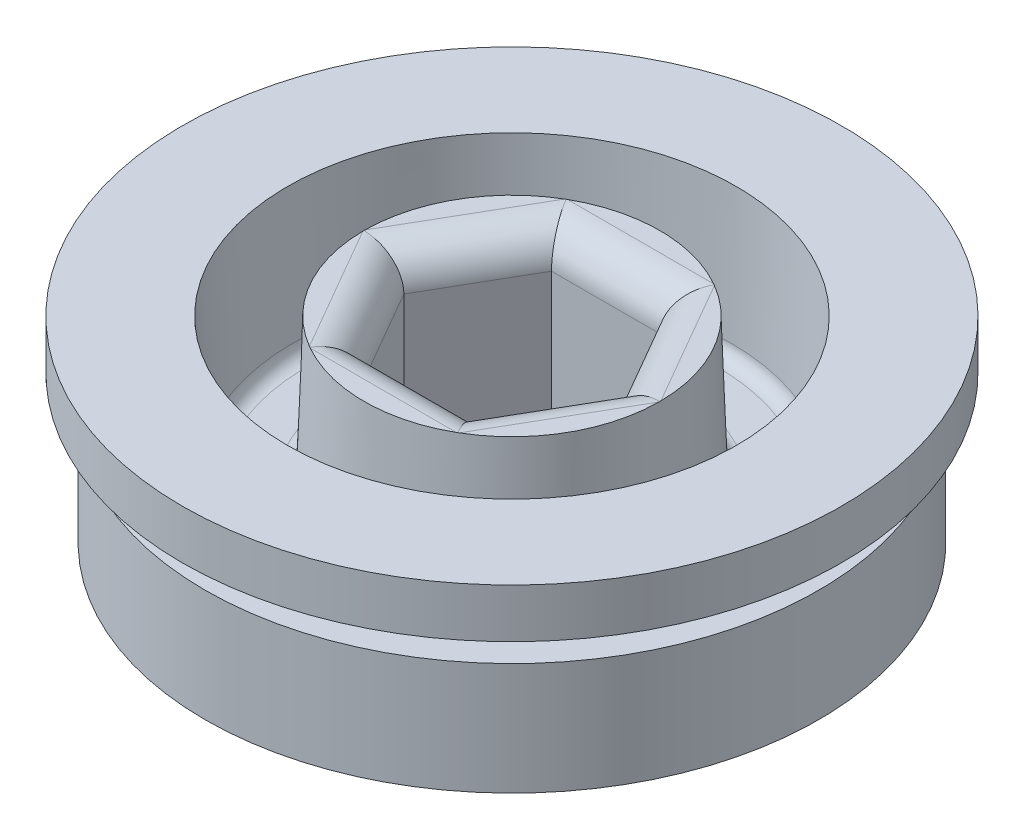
ISO-10303-21;
HEADER;
FILE_DESCRIPTION(('STEP AP214'),'2;1');
FILE_NAME('part.step','',(''),(''),'','','');
FILE_SCHEMA(('AUTOMOTIVE_DESIGN { 1 0 10303 214 1 1 1 1 }'));
ENDSEC;
DATA;
#1=APPLICATION_CONTEXT('core data for automotive mechanical design processes');
#2=APPLICATION_PROTOCOL_DEFINITION('international standard','automotive_design',2000,#1);
#3=PRODUCT_CONTEXT('',#1,'mechanical');
#4=PRODUCT('Part','Part','',(#3));
#5=PRODUCT_RELATED_PRODUCT_CATEGORY('part','',(#4));
#6=PRODUCT_DEFINITION_FORMATION('','',#4);
#7=PRODUCT_DEFINITION_CONTEXT('part definition',#1,'design');
#8=PRODUCT_DEFINITION('design','',#6,#7);
#9=PRODUCT_DEFINITION_SHAPE('','',#8);
#10=(LENGTH_UNIT() NAMED_UNIT(*) SI_UNIT(.MILLI.,.METRE.));
#11=(NAMED_UNIT(*) PLANE_ANGLE_UNIT() SI_UNIT($,.RADIAN.));
#12=(NAMED_UNIT(*) SI_UNIT($,.STERADIAN.) SOLID_ANGLE_UNIT());
#13=UNCERTAINTY_MEASURE_WITH_UNIT(LENGTH_MEASURE(1.E-05),#10,'distance_accuracy_value','');
#14=(GEOMETRIC_REPRESENTATION_CONTEXT(3) GLOBAL_UNCERTAINTY_ASSIGNED_CONTEXT((#13)) GLOBAL_UNIT_ASSIGNED_CONTEXT((#10,
#11,#12)) REPRESENTATION_CONTEXT('',''));
#15=CARTESIAN_POINT('',(0.,0.,0.));
#16=DIRECTION('',(0.,0.,1.));
#17=DIRECTION('',(1.,0.,0.));
#18=AXIS2_PLACEMENT_3D('',#15,#16,#17);
#19=CARTESIAN_POINT('',(0.,1.778,0.));
#20=DIRECTION('',(0.,1.,0.));
#21=DIRECTION('',(0.,0.,1.));
#22=AXIS2_PLACEMENT_3D('',#19,#20,#21);
#23=PLANE('',#22);
#24=DIRECTION('',(0.5,0.,-0.866025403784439));
#25=VECTOR('',#24,1.);
#26=CARTESIAN_POINT('',(3.05758929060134,1.778,4.0259));
#27=LINE('',#26,#25);
#28=CARTESIAN_POINT('',(5.35925593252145,1.778,0.0392964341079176));
#29=VERTEX_POINT('',#28);
#30=CARTESIAN_POINT('',(2.71365967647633,1.778,4.62160356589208));
#31=VERTEX_POINT('',#30);
#32=EDGE_CURVE('E158',#29,#31,#27,.F.);
#33=ORIENTED_EDGE('',*,*,#32,.T.);
#34=CARTESIAN_POINT('',(0.,1.778,0.));
#35=DIRECTION('',(0.,1.,0.));
#36=DIRECTION('',(0.,0.,1.));
#37=AXIS2_PLACEMENT_3D('',#34,#35,#36);
#38=CIRCLE('',#37,5.3594);
#39=EDGE_CURVE('E153',#31,#29,#38,.T.);
#40=ORIENTED_EDGE('',*,*,#39,.T.);
#41=EDGE_LOOP('',(#33,#40));
#42=FACE_BOUND('',#41,.T.);
#43=ADVANCED_FACE('F28',(#42),#23,.T.);
#44=DIRECTION('',(0.5,0.,0.866025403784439));
#45=VECTOR('',#44,1.);
#46=CARTESIAN_POINT('',(4.03645780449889,1.778,-2.33045));
#47=LINE('',#46,#45);
#48=CARTESIAN_POINT('',(2.71365967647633,1.778,-4.62160356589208));
#49=VERTEX_POINT('',#48);
#50=CARTESIAN_POINT('',(5.35925593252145,1.778,-0.0392964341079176));
#51=VERTEX_POINT('',#50);
#52=EDGE_CURVE('E164',#49,#51,#47,.T.);
#53=ORIENTED_EDGE('',*,*,#52,.T.);
#54=EDGE_CURVE('E357',#51,#49,#38,.T.);
#55=ORIENTED_EDGE('',*,*,#54,.T.);
#56=EDGE_LOOP('',(#53,#55));
#57=FACE_BOUND('',#56,.T.);
#58=ADVANCED_FACE('F314',(#57),#23,.T.);
#59=DIRECTION('',(1.,0.,0.));
#60=VECTOR('',#59,1.);
#61=CARTESIAN_POINT('',(0.,1.778,-4.6609));
#62=LINE('',#61,#60);
#63=CARTESIAN_POINT('',(-2.64559625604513,1.778,-4.6609));
#64=VERTEX_POINT('',#63);
#65=CARTESIAN_POINT('',(2.64559625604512,1.778,-4.6609));
#66=VERTEX_POINT('',#65);
#67=EDGE_CURVE('E556',#64,#66,#62,.T.);
#68=ORIENTED_EDGE('',*,*,#67,.T.);
#69=EDGE_CURVE('E359',#66,#64,#38,.T.);
#70=ORIENTED_EDGE('',*,*,#69,.T.);
#71=EDGE_LOOP('',(#68,#70));
#72=FACE_BOUND('',#71,.T.);
#73=ADVANCED_FACE('F326',(#72),#23,.T.);
#74=DIRECTION('',(-0.5,0.,0.866025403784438));
#75=VECTOR('',#74,1.);
#76=CARTESIAN_POINT('',(-3.05758929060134,1.778,-4.0259));
#77=LINE('',#76,#75);
#78=CARTESIAN_POINT('',(-5.35925593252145,1.778,-0.0392964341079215));
#79=VERTEX_POINT('',#78);
#80=CARTESIAN_POINT('',(-2.71365967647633,1.778,-4.62160356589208));
#81=VERTEX_POINT('',#80);
#82=EDGE_CURVE('E161',#79,#81,#77,.F.);
#83=ORIENTED_EDGE('',*,*,#82,.T.);
#84=EDGE_CURVE('E362',#81,#79,#38,.T.);
#85=ORIENTED_EDGE('',*,*,#84,.T.);
#86=EDGE_LOOP('',(#83,#85));
#87=FACE_BOUND('',#86,.T.);
#88=ADVANCED_FACE('F321',(#87),#23,.T.);
#89=DIRECTION('',(-0.5,0.,-0.866025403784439));
#90=VECTOR('',#89,1.);
#91=CARTESIAN_POINT('',(-4.03645780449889,1.778,2.33045));
#92=LINE('',#91,#90);
#93=CARTESIAN_POINT('',(-2.71365967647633,1.778,4.62160356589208));
#94=VERTEX_POINT('',#93);
#95=CARTESIAN_POINT('',(-5.35925593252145,1.778,0.039296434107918));
#96=VERTEX_POINT('',#95);
#97=EDGE_CURVE('E157',#94,#96,#92,.T.);
#98=ORIENTED_EDGE('',*,*,#97,.T.);
#99=EDGE_CURVE('E151',#96,#94,#38,.T.);
#100=ORIENTED_EDGE('',*,*,#99,.T.);
#101=EDGE_LOOP('',(#98,#100));
#102=FACE_BOUND('',#101,.T.);
#103=ADVANCED_FACE('F317',(#102),#23,.T.);
#104=DIRECTION('',(1.,0.,0.));
#105=VECTOR('',#104,1.);
#106=CARTESIAN_POINT('',(-1.9577370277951,1.778,4.6609));
#107=LINE('',#106,#105);
#108=CARTESIAN_POINT('',(2.64559625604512,1.778,4.6609));
#109=VERTEX_POINT('',#108);
#110=CARTESIAN_POINT('',(-2.64559625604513,1.778,4.6609));
#111=VERTEX_POINT('',#110);
#112=EDGE_CURVE('E150',#109,#111,#107,.F.);
#113=ORIENTED_EDGE('',*,*,#112,.T.);
#114=EDGE_CURVE('E138',#111,#109,#38,.T.);
#115=ORIENTED_EDGE('',*,*,#114,.T.);
#116=EDGE_LOOP('',(#113,#115));
#117=FACE_BOUND('',#116,.T.);
#118=ADVANCED_FACE('F149',(#117),#23,.T.);
#119=CARTESIAN_POINT('',(3.05758929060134,0.508,4.0259));
#120=DIRECTION('',(-0.5,0.,0.866025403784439));
#121=DIRECTION('',(0.866025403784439,0.,0.5));
#122=AXIS2_PLACEMENT_3D('',#119,#120,#121);
#123=CYLINDRICAL_SURFACE('',#122,1.27);
#124=CARTESIAN_POINT('',(2.69097186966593,0.508,4.6609));
#125=DIRECTION('',(-0.866025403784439,0.,0.5));
#126=DIRECTION('',(-0.5,0.,-0.866025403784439));
#127=AXIS2_PLACEMENT_3D('',#124,#125,#126);
#128=ELLIPSE('',#127,1.46646968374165,1.27);
#129=CARTESIAN_POINT('',(2.67970261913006,1.77784999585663,4.64138108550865));
#130=VERTEX_POINT('',#129);
#131=CARTESIAN_POINT('',(1.9577370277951,0.507999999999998,3.3909));
#132=VERTEX_POINT('',#131);
#133=EDGE_CURVE('E355',#130,#132,#128,.T.);
#134=ORIENTED_EDGE('',*,*,#133,.F.);
#135=CARTESIAN_POINT('',(2.64528726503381,1.77738669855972,4.66110000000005));
#136=CARTESIAN_POINT('',(2.70307202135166,1.77842549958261,4.62826566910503));
#137=CARTESIAN_POINT('',(2.76026595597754,1.77810903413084,4.59439620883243));
#138=CARTESIAN_POINT('',(2.87333157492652,1.77521470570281,4.52466381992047));
#139=CARTESIAN_POINT('',(2.92920388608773,1.77263793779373,4.48880186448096));
#140=CARTESIAN_POINT('',(3.09449500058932,1.76220307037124,4.37843720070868));
#141=CARTESIAN_POINT('',(3.2018147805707,1.75164094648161,4.30102683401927));
#142=CARTESIAN_POINT('',(3.41087950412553,1.72635068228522,4.13836618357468));
#143=CARTESIAN_POINT('',(3.51258376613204,1.71159596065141,4.05306829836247));
#144=CARTESIAN_POINT('',(3.70938130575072,1.68083102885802,3.87525940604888));
#145=CARTESIAN_POINT('',(3.80447070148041,1.66482009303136,3.78274422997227));
#146=CARTESIAN_POINT('',(3.99114982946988,1.63370806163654,3.58704740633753));
#147=CARTESIAN_POINT('',(4.08246341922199,1.61866581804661,3.48359208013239));
#148=CARTESIAN_POINT('',(4.25695808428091,1.59303451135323,3.26952688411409));
#149=CARTESIAN_POINT('',(4.34014138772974,1.58244422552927,3.15891898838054));
#150=CARTESIAN_POINT('',(4.49734087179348,1.56791987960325,2.9316842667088));
#151=CARTESIAN_POINT('',(4.57139773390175,1.56395521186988,2.81508769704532));
#152=CARTESIAN_POINT('',(4.71007077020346,1.56345579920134,2.57639531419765));
#153=CARTESIAN_POINT('',(4.77468720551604,1.566920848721,2.45429965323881));
#154=CARTESIAN_POINT('',(4.89099141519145,1.5801758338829,2.21192929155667));
#155=CARTESIAN_POINT('',(4.94316314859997,1.589641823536,2.09186728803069));
#156=CARTESIAN_POINT('',(5.03834619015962,1.61282715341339,1.84855866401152));
#157=CARTESIAN_POINT('',(5.0813553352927,1.62654749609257,1.72531129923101));
#158=CARTESIAN_POINT('',(5.15825191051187,1.65593634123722,1.47593333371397));
#159=CARTESIAN_POINT('',(5.19211837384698,1.67160920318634,1.34979681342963));
#160=CARTESIAN_POINT('',(5.25060377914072,1.70228585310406,1.09531971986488));
#161=CARTESIAN_POINT('',(5.27522239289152,1.71728961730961,0.96697906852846));
#162=CARTESIAN_POINT('',(5.31657096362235,1.7448339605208,0.699441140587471));
#163=CARTESIAN_POINT('',(5.33263107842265,1.75712980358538,0.560110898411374));
#164=CARTESIAN_POINT('',(5.34867875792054,1.7699082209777,0.350339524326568));
#165=CARTESIAN_POINT('',(5.3526875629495,1.77322291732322,0.28036486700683));
#166=CARTESIAN_POINT('',(5.35804439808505,1.77746100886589,0.140199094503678));
#167=CARTESIAN_POINT('',(5.35939070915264,1.77838285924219,0.0700078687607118));
#168=CARTESIAN_POINT('',(5.35940528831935,1.77784845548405,-0.000200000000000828));
#169=B_SPLINE_CURVE_WITH_KNOTS('',3,(#135,#136,#137,#138,#139,#140,#141,#142,#143,#144,#145,
#146,#147,#148,#149,#150,#151,#152,#153,#154,#155,#156,#157,#158,#159,#160,#161,#162,#163,#164,
#165,#166,#167,#168),.UNSPECIFIED.,.F.,.F.,(4,2,2,2,2,2,2,2,2,2,2,2,2,2,2,2,4),(0.,
0.19934792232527,0.398599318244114,0.796322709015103,1.19662621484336,1.59716268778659,
2.01313680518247,2.42899660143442,2.84292993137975,3.25685180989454,3.65013721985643,
4.04351537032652,4.43778812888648,4.83207487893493,5.25385746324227,5.46427993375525,
5.67483821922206),.UNSPECIFIED.);
#170=EDGE_CURVE('E141',#130,#31,#169,.T.);
#171=ORIENTED_EDGE('',*,*,#170,.T.);
#172=ORIENTED_EDGE('',*,*,#32,.F.);
#173=CARTESIAN_POINT('',(5.35940523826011,1.77784999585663,0.));
#174=VERTEX_POINT('',#173);
#175=EDGE_CURVE('E349',#29,#174,#169,.T.);
#176=ORIENTED_EDGE('',*,*,#175,.T.);
#177=CARTESIAN_POINT('',(5.38194373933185,0.508,0.));
#178=DIRECTION('',(0.,0.,1.));
#179=DIRECTION('',(-1.,0.,0.));
#180=AXIS2_PLACEMENT_3D('',#177,#178,#179);
#181=ELLIPSE('',#180,1.46646968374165,1.27);
#182=CARTESIAN_POINT('',(3.9154740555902,0.507999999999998,0.));
#183=VERTEX_POINT('',#182);
#184=EDGE_CURVE('E558',#183,#174,#181,.F.);
#185=ORIENTED_EDGE('',*,*,#184,.F.);
#186=DIRECTION('',(0.5,0.,-0.866025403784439));
#187=VECTOR('',#186,1.);
#188=CARTESIAN_POINT('',(3.9154740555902,0.508,0.));
#189=LINE('',#188,#187);
#190=EDGE_CURVE('E176',#132,#183,#189,.T.);
#191=ORIENTED_EDGE('',*,*,#190,.F.);
#192=EDGE_LOOP('',(#134,#171,#172,#176,#185,#191));
#193=FACE_BOUND('',#192,.T.);
#194=ADVANCED_FACE('F253',(#193),#123,.T.);
#195=CARTESIAN_POINT('',(4.03645780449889,0.508,-2.33045));
#196=DIRECTION('',(0.5,0.,0.866025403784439));
#197=DIRECTION('',(0.866025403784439,0.,-0.5));
#198=AXIS2_PLACEMENT_3D('',#195,#196,#197);
#199=CYLINDRICAL_SURFACE('',#198,1.27);
#200=ORIENTED_EDGE('',*,*,#184,.T.);
#201=CARTESIAN_POINT('',(5.35940528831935,1.77784845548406,0.00020000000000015));
#202=CARTESIAN_POINT('',(5.35939117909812,1.77836172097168,-0.0671206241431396));
#203=CARTESIAN_POINT('',(5.35815274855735,1.77753489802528,-0.134427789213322));
#204=CARTESIAN_POINT('',(5.35322574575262,1.7736595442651,-0.268860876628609));
#205=CARTESIAN_POINT('',(5.34953825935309,1.77061199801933,-0.335986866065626));
#206=CARTESIAN_POINT('',(5.3348165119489,1.75883851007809,-0.53670335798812));
#207=CARTESIAN_POINT('',(5.32012290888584,1.7474802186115,-0.669882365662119));
#208=CARTESIAN_POINT('',(5.28091153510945,1.72086401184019,-0.935226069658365));
#209=CARTESIAN_POINT('',(5.25633104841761,1.70558143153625,-1.06737869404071));
#210=CARTESIAN_POINT('',(5.19737173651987,1.67412266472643,-1.32944996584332));
#211=CARTESIAN_POINT('',(5.16298749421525,1.65794598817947,-1.45936733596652));
#212=CARTESIAN_POINT('',(5.08288029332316,1.6269424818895,-1.72150405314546));
#213=CARTESIAN_POINT('',(5.03676535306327,1.61219352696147,-1.85361369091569));
#214=CARTESIAN_POINT('',(4.93401205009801,1.58768787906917,-2.11413411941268));
#215=CARTESIAN_POINT('',(4.87737756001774,1.57792935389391,-2.24254625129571));
#216=CARTESIAN_POINT('',(4.75410299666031,1.56551293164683,-2.49415214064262));
#217=CARTESIAN_POINT('',(4.68750844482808,1.56282371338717,-2.61736652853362));
#218=CARTESIAN_POINT('',(4.54469595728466,1.56506544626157,-2.85801383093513));
#219=CARTESIAN_POINT('',(4.4684777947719,1.56999657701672,-2.97544660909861));
#220=CARTESIAN_POINT('',(4.3128075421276,1.58579954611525,-3.1955816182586));
#221=CARTESIAN_POINT('',(4.23395127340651,1.59623329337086,-3.2987400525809));
#222=CARTESIAN_POINT('',(4.06908419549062,1.62085850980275,-3.49876891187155));
#223=CARTESIAN_POINT('',(3.98306918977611,1.63505219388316,-3.59563558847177));
#224=CARTESIAN_POINT('',(3.80421241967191,1.66486586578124,-3.78289448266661));
#225=CARTESIAN_POINT('',(3.71136004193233,1.68048808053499,-3.87327618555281));
#226=CARTESIAN_POINT('',(3.5192854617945,1.71058043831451,-4.04719998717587));
#227=CARTESIAN_POINT('',(3.4200633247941,1.72505059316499,-4.13074215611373));
#228=CARTESIAN_POINT('',(3.2117054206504,1.75061994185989,-4.29377464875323));
#229=CARTESIAN_POINT('',(3.1023371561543,1.76157189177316,-4.37299442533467));
#230=CARTESIAN_POINT('',(2.93398231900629,1.77239912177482,-4.48570685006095));
#231=CARTESIAN_POINT('',(2.87719191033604,1.77507483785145,-4.52223258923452));
#232=CARTESIAN_POINT('',(2.76223468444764,1.77809753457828,-4.59322998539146));
#233=CARTESIAN_POINT('',(2.70406702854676,1.77844305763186,-4.62770034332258));
#234=CARTESIAN_POINT('',(2.64528726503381,1.77738669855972,-4.66110000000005));
#235=B_SPLINE_CURVE_WITH_KNOTS('',3,(#201,#202,#203,#204,#205,#206,#207,#208,#209,#210,#211,
#212,#213,#214,#215,#216,#217,#218,#219,#220,#221,#222,#223,#224,#225,#226,#227,#228,#229,#230,
#231,#232,#233,#234),.UNSPECIFIED.,.F.,.F.,(4,2,2,2,2,2,2,2,2,2,2,2,2,2,2,2,4),(0.,
0.201905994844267,0.40372252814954,0.80660861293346,1.21209169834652,1.61779927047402,
2.03942655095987,2.46089892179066,2.88050075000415,3.30011246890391,3.69047295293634,
4.0810639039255,4.4722744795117,4.86348103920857,5.26940034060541,5.4720511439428,
5.67482869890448),.UNSPECIFIED.);
#236=EDGE_CURVE('E345',#174,#51,#235,.T.);
#237=ORIENTED_EDGE('',*,*,#236,.T.);
#238=ORIENTED_EDGE('',*,*,#52,.F.);
#239=CARTESIAN_POINT('',(2.67970261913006,1.77784999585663,-4.64138108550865));
#240=VERTEX_POINT('',#239);
#241=EDGE_CURVE('E145',#49,#240,#235,.T.);
#242=ORIENTED_EDGE('',*,*,#241,.T.);
#243=CARTESIAN_POINT('',(2.69097186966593,0.508,-4.6609));
#244=DIRECTION('',(0.866025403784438,0.,0.5));
#245=DIRECTION('',(-0.5,0.,0.866025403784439));
#246=AXIS2_PLACEMENT_3D('',#243,#244,#245);
#247=ELLIPSE('',#246,1.46646968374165,1.27);
#248=CARTESIAN_POINT('',(1.9577370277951,0.507999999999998,-3.3909));
#249=VERTEX_POINT('',#248);
#250=EDGE_CURVE('E563',#249,#240,#247,.F.);
#251=ORIENTED_EDGE('',*,*,#250,.F.);
#252=DIRECTION('',(0.5,0.,0.866025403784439));
#253=VECTOR('',#252,1.);
#254=CARTESIAN_POINT('',(1.9577370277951,0.508,-3.3909));
#255=LINE('',#254,#253);
#256=EDGE_CURVE('E51',#183,#249,#255,.F.);
#257=ORIENTED_EDGE('',*,*,#256,.F.);
#258=EDGE_LOOP('',(#200,#237,#238,#242,#251,#257));
#259=FACE_BOUND('',#258,.T.);
#260=ADVANCED_FACE('F248',(#259),#199,.T.);
#261=CARTESIAN_POINT('',(-1.9577370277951,0.508,4.6609));
#262=DIRECTION('',(-1.,0.,0.));
#263=DIRECTION('',(0.,0.,1.));
#264=AXIS2_PLACEMENT_3D('',#261,#262,#263);
#265=CYLINDRICAL_SURFACE('',#264,1.27);
#266=ORIENTED_EDGE('',*,*,#112,.F.);
#267=CARTESIAN_POINT('',(2.6452438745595,1.77799998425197,4.6611));
#268=CARTESIAN_POINT('',(2.65291964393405,1.77800104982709,4.6567438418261));
#269=CARTESIAN_POINT('',(2.66058486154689,1.77797913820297,4.65236953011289));
#270=CARTESIAN_POINT('',(2.67589419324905,1.77788936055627,4.64358459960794));
#271=CARTESIAN_POINT('',(2.68353830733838,1.77782149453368,4.63917398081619));
#272=CARTESIAN_POINT('',(2.691171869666,1.77773065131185,4.63474520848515));
#273=B_SPLINE_CURVE_WITH_KNOTS('',3,(#267,#268,#269,#270,#271,#272),.UNSPECIFIED.,.F.,.F.,(4,2,
4),(0.,0.0264767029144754,0.0529534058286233),.UNSPECIFIED.);
#274=EDGE_CURVE('E135',#109,#130,#273,.T.);
#275=ORIENTED_EDGE('',*,*,#274,.T.);
#276=ORIENTED_EDGE('',*,*,#133,.T.);
#277=DIRECTION('',(1.,0.,0.));
#278=VECTOR('',#277,1.);
#279=CARTESIAN_POINT('',(1.9577370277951,0.508,3.3909));
#280=LINE('',#279,#278);
#281=CARTESIAN_POINT('',(-1.9577370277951,0.507999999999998,3.3909));
#282=VERTEX_POINT('',#281);
#283=EDGE_CURVE('E173',#282,#132,#280,.T.);
#284=ORIENTED_EDGE('',*,*,#283,.F.);
#285=CARTESIAN_POINT('',(-2.69097186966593,0.508,4.6609));
#286=DIRECTION('',(-0.866025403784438,0.,-0.5));
#287=DIRECTION('',(0.5,0.,-0.866025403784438));
#288=AXIS2_PLACEMENT_3D('',#285,#286,#287);
#289=ELLIPSE('',#288,1.46646968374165,1.27);
#290=CARTESIAN_POINT('',(-2.67970261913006,1.77784999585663,4.64138108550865));
#291=VERTEX_POINT('',#290);
#292=EDGE_CURVE('E610',#291,#282,#289,.T.);
#293=ORIENTED_EDGE('',*,*,#292,.F.);
#294=CARTESIAN_POINT('',(-2.691171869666,1.77773065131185,4.63474520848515));
#295=CARTESIAN_POINT('',(-2.68353830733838,1.77782149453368,4.63917398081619));
#296=CARTESIAN_POINT('',(-2.67589419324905,1.77788936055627,4.64358459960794));
#297=CARTESIAN_POINT('',(-2.66058486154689,1.77797913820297,4.65236953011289));
#298=CARTESIAN_POINT('',(-2.65291964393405,1.77800104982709,4.6567438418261));
#299=CARTESIAN_POINT('',(-2.6452438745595,1.77799998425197,4.6611));
#300=B_SPLINE_CURVE_WITH_KNOTS('',3,(#294,#295,#296,#297,#298,#299),.UNSPECIFIED.,.F.,.F.,(4,2,
4),(0.,0.0264767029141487,0.0529534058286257),.UNSPECIFIED.);
#301=EDGE_CURVE('E156',#291,#111,#300,.T.);
#302=ORIENTED_EDGE('',*,*,#301,.T.);
#303=EDGE_LOOP('',(#266,#275,#276,#284,#293,#302));
#304=FACE_BOUND('',#303,.T.);
#305=ADVANCED_FACE('F154',(#304),#265,.T.);
#306=CARTESIAN_POINT('',(0.,0.508,-4.6609));
#307=DIRECTION('',(1.,0.,0.));
#308=DIRECTION('',(0.,0.,-1.));
#309=AXIS2_PLACEMENT_3D('',#306,#307,#308);
#310=CYLINDRICAL_SURFACE('',#309,1.27);
#311=ORIENTED_EDGE('',*,*,#67,.F.);
#312=CARTESIAN_POINT('',(-2.64524387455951,1.77799998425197,-4.6611));
#313=CARTESIAN_POINT('',(-2.65291964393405,1.77800104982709,-4.6567438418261));
#314=CARTESIAN_POINT('',(-2.66058486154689,1.77797913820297,-4.65236953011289));
#315=CARTESIAN_POINT('',(-2.67589419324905,1.77788936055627,-4.64358459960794));
#316=CARTESIAN_POINT('',(-2.68353830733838,1.77782149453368,-4.63917398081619));
#317=CARTESIAN_POINT('',(-2.691171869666,1.77773065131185,-4.63474520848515));
#318=B_SPLINE_CURVE_WITH_KNOTS('',3,(#312,#313,#314,#315,#316,#317),.UNSPECIFIED.,.F.,.F.,(4,2,
4),(0.,0.0264767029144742,0.0529534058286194),.UNSPECIFIED.);
#319=CARTESIAN_POINT('',(-2.67970261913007,1.77784999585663,-4.64138108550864));
#320=VERTEX_POINT('',#319);
#321=EDGE_CURVE('E215',#64,#320,#318,.T.);
#322=ORIENTED_EDGE('',*,*,#321,.T.);
#323=CARTESIAN_POINT('',(-2.69097186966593,0.508,-4.6609));
#324=DIRECTION('',(0.866025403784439,0.,-0.5));
#325=DIRECTION('',(-0.5,0.,-0.866025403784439));
#326=AXIS2_PLACEMENT_3D('',#323,#324,#325);
#327=ELLIPSE('',#326,1.46646968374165,1.27);
#328=CARTESIAN_POINT('',(-1.9577370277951,0.507999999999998,-3.3909));
#329=VERTEX_POINT('',#328);
#330=EDGE_CURVE('E370',#329,#320,#327,.F.);
#331=ORIENTED_EDGE('',*,*,#330,.F.);
#332=DIRECTION('',(1.,0.,0.));
#333=VECTOR('',#332,1.);
#334=CARTESIAN_POINT('',(-1.9577370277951,0.508,-3.3909));
#335=LINE('',#334,#333);
#336=EDGE_CURVE('E179',#249,#329,#335,.F.);
#337=ORIENTED_EDGE('',*,*,#336,.F.);
#338=ORIENTED_EDGE('',*,*,#250,.T.);
#339=CARTESIAN_POINT('',(2.691171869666,1.77773065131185,-4.63474520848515));
#340=CARTESIAN_POINT('',(2.68353830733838,1.77782149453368,-4.63917398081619));
#341=CARTESIAN_POINT('',(2.67589419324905,1.77788936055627,-4.64358459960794));
#342=CARTESIAN_POINT('',(2.66058486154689,1.77797913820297,-4.65236953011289));
#343=CARTESIAN_POINT('',(2.65291964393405,1.77800104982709,-4.6567438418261));
#344=CARTESIAN_POINT('',(2.64524387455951,1.77799998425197,-4.6611));
#345=B_SPLINE_CURVE_WITH_KNOTS('',3,(#339,#340,#341,#342,#343,#344),.UNSPECIFIED.,.F.,.F.,(4,2,
4),(0.,0.0264767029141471,0.0529534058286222),.UNSPECIFIED.);
#346=EDGE_CURVE('E228',#240,#66,#345,.T.);
#347=ORIENTED_EDGE('',*,*,#346,.T.);
#348=EDGE_LOOP('',(#311,#322,#331,#337,#338,#347));
#349=FACE_BOUND('',#348,.T.);
#350=ADVANCED_FACE('F247',(#349),#310,.T.);
#351=CARTESIAN_POINT('',(-4.03645780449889,0.508,2.33045));
#352=DIRECTION('',(-0.5,0.,-0.866025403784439));
#353=DIRECTION('',(-0.866025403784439,0.,0.5));
#354=AXIS2_PLACEMENT_3D('',#351,#352,#353);
#355=CYLINDRICAL_SURFACE('',#354,1.27);
#356=CARTESIAN_POINT('',(-5.38194373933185,0.508,0.));
#357=DIRECTION('',(0.,0.,-1.));
#358=DIRECTION('',(1.,0.,0.));
#359=AXIS2_PLACEMENT_3D('',#356,#357,#358);
#360=ELLIPSE('',#359,1.46646968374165,1.27);
#361=CARTESIAN_POINT('',(-5.35940523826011,1.77784999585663,0.));
#362=VERTEX_POINT('',#361);
#363=CARTESIAN_POINT('',(-3.9154740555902,0.507999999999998,0.));
#364=VERTEX_POINT('',#363);
#365=EDGE_CURVE('E335',#362,#364,#360,.T.);
#366=ORIENTED_EDGE('',*,*,#365,.F.);
#367=CARTESIAN_POINT('',(-5.35940528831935,1.77784845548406,-0.000200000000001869));
#368=CARTESIAN_POINT('',(-5.35939117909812,1.77836172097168,0.0671206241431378));
#369=CARTESIAN_POINT('',(-5.35815274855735,1.77753489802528,0.13442778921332));
#370=CARTESIAN_POINT('',(-5.35322574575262,1.7736595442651,0.268860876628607));
#371=CARTESIAN_POINT('',(-5.34953825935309,1.77061199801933,0.335986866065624));
#372=CARTESIAN_POINT('',(-5.3348165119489,1.75883851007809,0.536703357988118));
#373=CARTESIAN_POINT('',(-5.32012290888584,1.7474802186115,0.669882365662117));
#374=CARTESIAN_POINT('',(-5.28091153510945,1.72086401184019,0.935226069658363));
#375=CARTESIAN_POINT('',(-5.25633104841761,1.70558143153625,1.06737869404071));
#376=CARTESIAN_POINT('',(-5.19737173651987,1.67412266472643,1.32944996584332));
#377=CARTESIAN_POINT('',(-5.16298749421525,1.65794598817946,1.45936733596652));
#378=CARTESIAN_POINT('',(-5.08288029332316,1.6269424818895,1.72150405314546));
#379=CARTESIAN_POINT('',(-5.03676535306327,1.61219352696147,1.85361369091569));
#380=CARTESIAN_POINT('',(-4.93401205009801,1.58768787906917,2.11413411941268));
#381=CARTESIAN_POINT('',(-4.87737756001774,1.57792935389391,2.24254625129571));
#382=CARTESIAN_POINT('',(-4.75410299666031,1.56551293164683,2.49415214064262));
#383=CARTESIAN_POINT('',(-4.68750844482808,1.56282371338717,2.61736652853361));
#384=CARTESIAN_POINT('',(-4.54469595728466,1.56506544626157,2.85801383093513));
#385=CARTESIAN_POINT('',(-4.46847779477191,1.56999657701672,2.97544660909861));
#386=CARTESIAN_POINT('',(-4.3128075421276,1.58579954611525,3.1955816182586));
#387=CARTESIAN_POINT('',(-4.23395127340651,1.59623329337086,3.2987400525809));
#388=CARTESIAN_POINT('',(-4.06908419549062,1.62085850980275,3.49876891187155));
#389=CARTESIAN_POINT('',(-3.98306918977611,1.63505219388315,3.59563558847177));
#390=CARTESIAN_POINT('',(-3.80421241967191,1.66486586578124,3.78289448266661));
#391=CARTESIAN_POINT('',(-3.71136004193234,1.68048808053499,3.87327618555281));
#392=CARTESIAN_POINT('',(-3.5192854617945,1.71058043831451,4.04719998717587));
#393=CARTESIAN_POINT('',(-3.4200633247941,1.72505059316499,4.13074215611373));
#394=CARTESIAN_POINT('',(-3.2117054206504,1.75061994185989,4.29377464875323));
#395=CARTESIAN_POINT('',(-3.1023371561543,1.76157189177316,4.37299442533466));
#396=CARTESIAN_POINT('',(-2.93398231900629,1.77239912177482,4.48570685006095));
#397=CARTESIAN_POINT('',(-2.87719191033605,1.77507483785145,4.52223258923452));
#398=CARTESIAN_POINT('',(-2.76223468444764,1.77809753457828,4.59322998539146));
#399=CARTESIAN_POINT('',(-2.70406702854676,1.77844305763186,4.62770034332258));
#400=CARTESIAN_POINT('',(-2.64528726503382,1.77738669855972,4.66110000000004));
#401=B_SPLINE_CURVE_WITH_KNOTS('',3,(#367,#368,#369,#370,#371,#372,#373,#374,#375,#376,#377,
#378,#379,#380,#381,#382,#383,#384,#385,#386,#387,#388,#389,#390,#391,#392,#393,#394,#395,#396,
#397,#398,#399,#400),.UNSPECIFIED.,.F.,.F.,(4,2,2,2,2,2,2,2,2,2,2,2,2,2,2,2,4),(0.,
0.201905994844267,0.40372252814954,0.80660861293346,1.21209169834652,1.61779927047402,
2.03942655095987,2.46089892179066,2.88050075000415,3.30011246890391,3.69047295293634,
4.0810639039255,4.4722744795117,4.86348103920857,5.26940034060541,5.47205114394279,
5.67482869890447),.UNSPECIFIED.);
#402=EDGE_CURVE('E43',#362,#96,#401,.T.);
#403=ORIENTED_EDGE('',*,*,#402,.T.);
#404=ORIENTED_EDGE('',*,*,#97,.F.);
#405=EDGE_CURVE('E333',#94,#291,#401,.T.);
#406=ORIENTED_EDGE('',*,*,#405,.T.);
#407=ORIENTED_EDGE('',*,*,#292,.T.);
#408=DIRECTION('',(-0.5,0.,-0.866025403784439));
#409=VECTOR('',#408,1.);
#410=CARTESIAN_POINT('',(-1.9577370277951,0.508,3.3909));
#411=LINE('',#410,#409);
#412=EDGE_CURVE('E170',#364,#282,#411,.F.);
#413=ORIENTED_EDGE('',*,*,#412,.F.);
#414=EDGE_LOOP('',(#366,#403,#404,#406,#407,#413));
#415=FACE_BOUND('',#414,.T.);
#416=ADVANCED_FACE('F309',(#415),#355,.T.);
#417=CARTESIAN_POINT('',(-3.05758929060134,0.508,-4.0259));
#418=DIRECTION('',(0.5,0.,-0.866025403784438));
#419=DIRECTION('',(-0.866025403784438,0.,-0.5));
#420=AXIS2_PLACEMENT_3D('',#417,#418,#419);
#421=CYLINDRICAL_SURFACE('',#420,1.27);
#422=ORIENTED_EDGE('',*,*,#330,.T.);
#423=CARTESIAN_POINT('',(-2.64528726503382,1.77738669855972,-4.66110000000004));
#424=CARTESIAN_POINT('',(-2.70307202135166,1.77842549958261,-4.62826566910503));
#425=CARTESIAN_POINT('',(-2.76026595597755,1.77810903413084,-4.59439620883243));
#426=CARTESIAN_POINT('',(-2.87333157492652,1.77521470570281,-4.52466381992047));
#427=CARTESIAN_POINT('',(-2.92920388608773,1.77263793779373,-4.48880186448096));
#428=CARTESIAN_POINT('',(-3.09449500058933,1.76220307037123,-4.37843720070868));
#429=CARTESIAN_POINT('',(-3.2018147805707,1.7516409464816,-4.30102683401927));
#430=CARTESIAN_POINT('',(-3.41087950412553,1.72635068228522,-4.13836618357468));
#431=CARTESIAN_POINT('',(-3.51258376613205,1.71159596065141,-4.05306829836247));
#432=CARTESIAN_POINT('',(-3.70938130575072,1.68083102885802,-3.87525940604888));
#433=CARTESIAN_POINT('',(-3.80447070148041,1.66482009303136,-3.78274422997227));
#434=CARTESIAN_POINT('',(-3.99114982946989,1.63370806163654,-3.58704740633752));
#435=CARTESIAN_POINT('',(-4.082463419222,1.61866581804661,-3.48359208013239));
#436=CARTESIAN_POINT('',(-4.25695808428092,1.59303451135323,-3.26952688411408));
#437=CARTESIAN_POINT('',(-4.34014138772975,1.58244422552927,-3.15891898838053));
#438=CARTESIAN_POINT('',(-4.49734087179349,1.56791987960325,-2.9316842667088));
#439=CARTESIAN_POINT('',(-4.57139773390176,1.56395521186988,-2.81508769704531));
#440=CARTESIAN_POINT('',(-4.71007077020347,1.56345579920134,-2.57639531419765));
#441=CARTESIAN_POINT('',(-4.77468720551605,1.566920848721,-2.4542996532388));
#442=CARTESIAN_POINT('',(-4.89099141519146,1.5801758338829,-2.21192929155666));
#443=CARTESIAN_POINT('',(-4.94316314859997,1.589641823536,-2.09186728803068));
#444=CARTESIAN_POINT('',(-5.03834619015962,1.61282715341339,-1.84855866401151));
#445=CARTESIAN_POINT('',(-5.0813553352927,1.62654749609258,-1.725311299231));
#446=CARTESIAN_POINT('',(-5.15825191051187,1.65593634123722,-1.47593333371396));
#447=CARTESIAN_POINT('',(-5.19211837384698,1.67160920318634,-1.34979681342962));
#448=CARTESIAN_POINT('',(-5.25060377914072,1.70228585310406,-1.09531971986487));
#449=CARTESIAN_POINT('',(-5.27522239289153,1.71728961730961,-0.966979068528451));
#450=CARTESIAN_POINT('',(-5.31657096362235,1.7448339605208,-0.699441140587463));
#451=CARTESIAN_POINT('',(-5.33263107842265,1.75712980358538,-0.560110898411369));
#452=CARTESIAN_POINT('',(-5.34867875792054,1.7699082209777,-0.350339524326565));
#453=CARTESIAN_POINT('',(-5.3526875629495,1.77322291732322,-0.280364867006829));
#454=CARTESIAN_POINT('',(-5.35804439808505,1.77746100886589,-0.140199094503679));
#455=CARTESIAN_POINT('',(-5.35939070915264,1.77838285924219,-0.0700078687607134));
#456=CARTESIAN_POINT('',(-5.35940528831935,1.77784845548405,0.00019999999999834));
#457=B_SPLINE_CURVE_WITH_KNOTS('',3,(#423,#424,#425,#426,#427,#428,#429,#430,#431,#432,#433,
#434,#435,#436,#437,#438,#439,#440,#441,#442,#443,#444,#445,#446,#447,#448,#449,#450,#451,#452,
#453,#454,#455,#456),.UNSPECIFIED.,.F.,.F.,(4,2,2,2,2,2,2,2,2,2,2,2,2,2,2,2,4),(0.,
0.19934792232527,0.398599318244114,0.796322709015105,1.19662621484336,1.5971626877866,
2.01313680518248,2.42899660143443,2.84292993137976,3.25685180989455,3.65013721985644,
4.04351537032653,4.43778812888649,4.83207487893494,5.25385746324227,5.46427993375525,
5.67483821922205),.UNSPECIFIED.);
#458=EDGE_CURVE('E188',#320,#81,#457,.T.);
#459=ORIENTED_EDGE('',*,*,#458,.T.);
#460=ORIENTED_EDGE('',*,*,#82,.F.);
#461=EDGE_CURVE('E181',#79,#362,#457,.T.);
#462=ORIENTED_EDGE('',*,*,#461,.T.);
#463=ORIENTED_EDGE('',*,*,#365,.T.);
#464=DIRECTION('',(-0.5,0.,0.866025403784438));
#465=VECTOR('',#464,1.);
#466=CARTESIAN_POINT('',(-3.9154740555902,0.508,0.));
#467=LINE('',#466,#465);
#468=EDGE_CURVE('E553',#329,#364,#467,.T.);
#469=ORIENTED_EDGE('',*,*,#468,.F.);
#470=EDGE_LOOP('',(#422,#459,#460,#462,#463,#469));
#471=FACE_BOUND('',#470,.T.);
#472=ADVANCED_FACE('F191',(#471),#421,.T.);
#473=CARTESIAN_POINT('',(0.,1.778,0.));
#474=DIRECTION('',(0.,1.,0.));
#475=DIRECTION('',(0.,0.,1.));
#476=AXIS2_PLACEMENT_3D('',#473,#474,#475);
#477=CIRCLE('',#476,8.128);
#478=CARTESIAN_POINT('',(0.,1.778,8.128));
#479=VERTEX_POINT('',#478);
#480=EDGE_CURVE('E336',#479,#479,#477,.T.);
#481=ORIENTED_EDGE('',*,*,#480,.F.);
#482=EDGE_LOOP('',(#481));
#483=FACE_BOUND('',#482,.T.);
#484=CARTESIAN_POINT('',(0.,1.778,0.));
#485=DIRECTION('',(0.,1.,0.));
#486=DIRECTION('',(0.,0.,1.));
#487=AXIS2_PLACEMENT_3D('',#484,#485,#486);
#488=CIRCLE('',#487,11.938);
#489=CARTESIAN_POINT('',(0.,1.778,11.938));
#490=VERTEX_POINT('',#489);
#491=EDGE_CURVE('E545',#490,#490,#488,.T.);
#492=ORIENTED_EDGE('',*,*,#491,.T.);
#493=EDGE_LOOP('',(#492));
#494=FACE_BOUND('',#493,.T.);
#495=ADVANCED_FACE('F301',(#483,#494),#23,.T.);
#496=CARTESIAN_POINT('',(0.,-5.334,0.));
#497=DIRECTION('',(0.,1.,0.));
#498=DIRECTION('',(0.,0.,1.));
#499=AXIS2_PLACEMENT_3D('',#496,#497,#498);
#500=PLANE('',#499);
#501=CARTESIAN_POINT('',(0.,-5.334,0.));
#502=DIRECTION('',(0.,1.,0.));
#503=DIRECTION('',(0.,0.,1.));
#504=AXIS2_PLACEMENT_3D('',#501,#502,#503);
#505=CIRCLE('',#504,11.1125);
#506=CARTESIAN_POINT('',(0.,-5.334,11.1125));
#507=VERTEX_POINT('',#506);
#508=EDGE_CURVE('E536',#507,#507,#505,.T.);
#509=ORIENTED_EDGE('',*,*,#508,.F.);
#510=EDGE_LOOP('',(#509));
#511=FACE_BOUND('',#510,.T.);
#512=DIRECTION('',(0.5,0.,0.866025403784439));
#513=VECTOR('',#512,1.);
#514=CARTESIAN_POINT('',(1.9577370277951,-5.334,-3.3909));
#515=LINE('',#514,#513);
#516=CARTESIAN_POINT('',(1.9577370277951,-5.334,-3.3909));
#517=VERTEX_POINT('',#516);
#518=CARTESIAN_POINT('',(3.9154740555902,-5.334,0.));
#519=VERTEX_POINT('',#518);
#520=EDGE_CURVE('E559',#517,#519,#515,.T.);
#521=ORIENTED_EDGE('',*,*,#520,.F.);
#522=DIRECTION('',(1.,0.,0.));
#523=VECTOR('',#522,1.);
#524=CARTESIAN_POINT('',(-1.9577370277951,-5.334,-3.3909));
#525=LINE('',#524,#523);
#526=CARTESIAN_POINT('',(-1.9577370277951,-5.334,-3.3909));
#527=VERTEX_POINT('',#526);
#528=EDGE_CURVE('E577',#527,#517,#525,.T.);
#529=ORIENTED_EDGE('',*,*,#528,.F.);
#530=DIRECTION('',(-0.5,0.,0.866025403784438));
#531=VECTOR('',#530,1.);
#532=CARTESIAN_POINT('',(-1.9577370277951,-5.334,-3.3909));
#533=LINE('',#532,#531);
#534=CARTESIAN_POINT('',(-3.9154740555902,-5.334,0.));
#535=VERTEX_POINT('',#534);
#536=EDGE_CURVE('E574',#527,#535,#533,.T.);
#537=ORIENTED_EDGE('',*,*,#536,.T.);
#538=DIRECTION('',(-0.5,0.,-0.866025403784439));
#539=VECTOR('',#538,1.);
#540=CARTESIAN_POINT('',(-1.9577370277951,-5.334,3.3909));
#541=LINE('',#540,#539);
#542=CARTESIAN_POINT('',(-1.9577370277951,-5.334,3.3909));
#543=VERTEX_POINT('',#542);
#544=EDGE_CURVE('E572',#543,#535,#541,.T.);
#545=ORIENTED_EDGE('',*,*,#544,.F.);
#546=DIRECTION('',(1.,0.,0.));
#547=VECTOR('',#546,1.);
#548=CARTESIAN_POINT('',(-1.9577370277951,-5.334,3.3909));
#549=LINE('',#548,#547);
#550=CARTESIAN_POINT('',(1.9577370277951,-5.334,3.3909));
#551=VERTEX_POINT('',#550);
#552=EDGE_CURVE('E569',#543,#551,#549,.T.);
#553=ORIENTED_EDGE('',*,*,#552,.T.);
#554=DIRECTION('',(0.5,0.,-0.866025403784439));
#555=VECTOR('',#554,1.);
#556=CARTESIAN_POINT('',(1.9577370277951,-5.334,3.3909));
#557=LINE('',#556,#555);
#558=EDGE_CURVE('E561',#551,#519,#557,.T.);
#559=ORIENTED_EDGE('',*,*,#558,.T.);
#560=EDGE_LOOP('',(#521,#529,#537,#545,#553,#559));
#561=FACE_BOUND('',#560,.T.);
#562=ADVANCED_FACE('F295',(#511,#561),#500,.F.);
#563=CARTESIAN_POINT('',(0.,0.,0.));
#564=DIRECTION('',(0.,1.,0.));
#565=DIRECTION('',(0.,0.,1.));
#566=AXIS2_PLACEMENT_3D('',#563,#564,#565);
#567=PLANE('',#566);
#568=CARTESIAN_POINT('',(0.,0.,0.));
#569=DIRECTION('',(0.,1.,0.));
#570=DIRECTION('',(0.,0.,1.));
#571=AXIS2_PLACEMENT_3D('',#568,#569,#570);
#572=CIRCLE('',#571,11.938);
#573=CARTESIAN_POINT('',(0.,0.,11.938));
#574=VERTEX_POINT('',#573);
#575=EDGE_CURVE('E541',#574,#574,#572,.T.);
#576=ORIENTED_EDGE('',*,*,#575,.F.);
#577=EDGE_LOOP('',(#576));
#578=FACE_BOUND('',#577,.T.);
#579=CARTESIAN_POINT('',(0.,0.,0.));
#580=DIRECTION('',(0.,1.,0.));
#581=DIRECTION('',(0.,0.,1.));
#582=AXIS2_PLACEMENT_3D('',#579,#580,#581);
#583=CIRCLE('',#582,10.1346);
#584=CARTESIAN_POINT('',(0.,0.,10.1346));
#585=VERTEX_POINT('',#584);
#586=EDGE_CURVE('E548',#585,#585,#583,.T.);
#587=ORIENTED_EDGE('',*,*,#586,.T.);
#588=EDGE_LOOP('',(#587));
#589=FACE_BOUND('',#588,.T.);
#590=ADVANCED_FACE('F292',(#578,#589),#567,.F.);
#591=CARTESIAN_POINT('',(0.,35.54376301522,0.));
#592=DIRECTION('',(0.,-1.,0.));
#593=DIRECTION('',(0.,0.,-1.));
#594=AXIS2_PLACEMENT_3D('',#591,#592,#593);
#595=CYLINDRICAL_SURFACE('',#594,11.938);
#596=ORIENTED_EDGE('',*,*,#575,.T.);
#597=EDGE_LOOP('',(#596));
#598=FACE_BOUND('',#597,.T.);
#599=ORIENTED_EDGE('',*,*,#491,.F.);
#600=EDGE_LOOP('',(#599));
#601=FACE_BOUND('',#600,.T.);
#602=ADVANCED_FACE('F290',(#598,#601),#595,.T.);
#603=CARTESIAN_POINT('',(0.,-1.27,0.));
#604=DIRECTION('',(0.,1.,0.));
#605=DIRECTION('',(0.,0.,1.));
#606=AXIS2_PLACEMENT_3D('',#603,#604,#605);
#607=PLANE('',#606);
#608=CARTESIAN_POINT('',(0.,-1.27,0.));
#609=DIRECTION('',(0.,1.,0.));
#610=DIRECTION('',(0.,0.,1.));
#611=AXIS2_PLACEMENT_3D('',#608,#609,#610);
#612=CIRCLE('',#611,10.1346);
#613=CARTESIAN_POINT('',(0.,-1.27,10.1346));
#614=VERTEX_POINT('',#613);
#615=EDGE_CURVE('E542',#614,#614,#612,.T.);
#616=ORIENTED_EDGE('',*,*,#615,.F.);
#617=EDGE_LOOP('',(#616));
#618=FACE_BOUND('',#617,.T.);
#619=CARTESIAN_POINT('',(0.,-1.27,0.));
#620=DIRECTION('',(0.,1.,0.));
#621=DIRECTION('',(0.,0.,1.));
#622=AXIS2_PLACEMENT_3D('',#619,#620,#621);
#623=CIRCLE('',#622,11.1125);
#624=CARTESIAN_POINT('',(0.,-1.27,11.1125));
#625=VERTEX_POINT('',#624);
#626=EDGE_CURVE('E539',#625,#625,#623,.T.);
#627=ORIENTED_EDGE('',*,*,#626,.T.);
#628=EDGE_LOOP('',(#627));
#629=FACE_BOUND('',#628,.T.);
#630=ADVANCED_FACE('F286',(#618,#629),#607,.T.);
#631=CARTESIAN_POINT('',(0.,-1.27,0.));
#632=DIRECTION('',(0.,1.,0.));
#633=DIRECTION('',(0.,0.,1.));
#634=AXIS2_PLACEMENT_3D('',#631,#632,#633);
#635=CYLINDRICAL_SURFACE('',#634,10.1346);
#636=ORIENTED_EDGE('',*,*,#615,.T.);
#637=EDGE_LOOP('',(#636));
#638=FACE_BOUND('',#637,.T.);
#639=ORIENTED_EDGE('',*,*,#586,.F.);
#640=EDGE_LOOP('',(#639));
#641=FACE_BOUND('',#640,.T.);
#642=ADVANCED_FACE('F283',(#638,#641),#635,.T.);
#643=CARTESIAN_POINT('',(0.,1.778,0.));
#644=DIRECTION('',(0.,-1.,0.));
#645=DIRECTION('',(0.,0.,-1.));
#646=AXIS2_PLACEMENT_3D('',#643,#644,#645);
#647=CYLINDRICAL_SURFACE('',#646,11.1125);
#648=ORIENTED_EDGE('',*,*,#508,.T.);
#649=EDGE_LOOP('',(#648));
#650=FACE_BOUND('',#649,.T.);
#651=ORIENTED_EDGE('',*,*,#626,.F.);
#652=EDGE_LOOP('',(#651));
#653=FACE_BOUND('',#652,.T.);
#654=ADVANCED_FACE('F30',(#650,#653),#647,.T.);
#655=CARTESIAN_POINT('',(1.9577370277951,-5.334,-3.3909));
#656=DIRECTION('',(-0.866025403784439,0.,0.5));
#657=DIRECTION('',(0.5,0.,0.866025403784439));
#658=AXIS2_PLACEMENT_3D('',#655,#656,#657);
#659=PLANE('',#658);
#660=DIRECTION('',(0.,1.,0.));
#661=VECTOR('',#660,1.);
#662=CARTESIAN_POINT('',(3.9154740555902,-5.334,0.));
#663=LINE('',#662,#661);
#664=EDGE_CURVE('E593',#519,#183,#663,.T.);
#665=ORIENTED_EDGE('',*,*,#664,.T.);
#666=ORIENTED_EDGE('',*,*,#256,.T.);
#667=DIRECTION('',(0.,1.,0.));
#668=VECTOR('',#667,1.);
#669=CARTESIAN_POINT('',(1.9577370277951,-5.334,-3.3909));
#670=LINE('',#669,#668);
#671=EDGE_CURVE('E579',#517,#249,#670,.T.);
#672=ORIENTED_EDGE('',*,*,#671,.F.);
#673=ORIENTED_EDGE('',*,*,#520,.T.);
#674=EDGE_LOOP('',(#665,#666,#672,#673));
#675=FACE_BOUND('',#674,.T.);
#676=ADVANCED_FACE('F279',(#675),#659,.T.);
#677=CARTESIAN_POINT('',(1.9577370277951,-5.334,3.3909));
#678=DIRECTION('',(0.866025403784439,0.,0.5));
#679=DIRECTION('',(0.5,0.,-0.866025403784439));
#680=AXIS2_PLACEMENT_3D('',#677,#678,#679);
#681=PLANE('',#680);
#682=DIRECTION('',(0.,1.,0.));
#683=VECTOR('',#682,1.);
#684=CARTESIAN_POINT('',(1.9577370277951,-5.334,3.3909));
#685=LINE('',#684,#683);
#686=EDGE_CURVE('E590',#551,#132,#685,.T.);
#687=ORIENTED_EDGE('',*,*,#686,.T.);
#688=ORIENTED_EDGE('',*,*,#190,.T.);
#689=ORIENTED_EDGE('',*,*,#664,.F.);
#690=ORIENTED_EDGE('',*,*,#558,.F.);
#691=EDGE_LOOP('',(#687,#688,#689,#690));
#692=FACE_BOUND('',#691,.T.);
#693=ADVANCED_FACE('F275',(#692),#681,.F.);
#694=CARTESIAN_POINT('',(-1.9577370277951,-5.334,3.3909));
#695=DIRECTION('',(0.,0.,1.));
#696=DIRECTION('',(1.,0.,0.));
#697=AXIS2_PLACEMENT_3D('',#694,#695,#696);
#698=PLANE('',#697);
#699=DIRECTION('',(0.,1.,0.));
#700=VECTOR('',#699,1.);
#701=CARTESIAN_POINT('',(-1.9577370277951,-5.334,3.3909));
#702=LINE('',#701,#700);
#703=EDGE_CURVE('E587',#543,#282,#702,.T.);
#704=ORIENTED_EDGE('',*,*,#703,.T.);
#705=ORIENTED_EDGE('',*,*,#283,.T.);
#706=ORIENTED_EDGE('',*,*,#686,.F.);
#707=ORIENTED_EDGE('',*,*,#552,.F.);
#708=EDGE_LOOP('',(#704,#705,#706,#707));
#709=FACE_BOUND('',#708,.T.);
#710=ADVANCED_FACE('F271',(#709),#698,.F.);
#711=CARTESIAN_POINT('',(-1.9577370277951,-5.334,3.3909));
#712=DIRECTION('',(0.866025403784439,0.,-0.5));
#713=DIRECTION('',(-0.5,0.,-0.866025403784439));
#714=AXIS2_PLACEMENT_3D('',#711,#712,#713);
#715=PLANE('',#714);
#716=DIRECTION('',(0.,1.,0.));
#717=VECTOR('',#716,1.);
#718=CARTESIAN_POINT('',(-3.9154740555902,-5.334,0.));
#719=LINE('',#718,#717);
#720=EDGE_CURVE('E584',#535,#364,#719,.T.);
#721=ORIENTED_EDGE('',*,*,#720,.T.);
#722=ORIENTED_EDGE('',*,*,#412,.T.);
#723=ORIENTED_EDGE('',*,*,#703,.F.);
#724=ORIENTED_EDGE('',*,*,#544,.T.);
#725=EDGE_LOOP('',(#721,#722,#723,#724));
#726=FACE_BOUND('',#725,.T.);
#727=ADVANCED_FACE('F267',(#726),#715,.T.);
#728=CARTESIAN_POINT('',(-1.9577370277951,-5.334,-3.3909));
#729=DIRECTION('',(-0.866025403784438,0.,-0.5));
#730=DIRECTION('',(-0.5,0.,0.866025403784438));
#731=AXIS2_PLACEMENT_3D('',#728,#729,#730);
#732=PLANE('',#731);
#733=DIRECTION('',(0.,1.,0.));
#734=VECTOR('',#733,1.);
#735=CARTESIAN_POINT('',(-1.9577370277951,-5.334,-3.3909));
#736=LINE('',#735,#734);
#737=EDGE_CURVE('E581',#527,#329,#736,.T.);
#738=ORIENTED_EDGE('',*,*,#737,.T.);
#739=ORIENTED_EDGE('',*,*,#468,.T.);
#740=ORIENTED_EDGE('',*,*,#720,.F.);
#741=ORIENTED_EDGE('',*,*,#536,.F.);
#742=EDGE_LOOP('',(#738,#739,#740,#741));
#743=FACE_BOUND('',#742,.T.);
#744=ADVANCED_FACE('F263',(#743),#732,.F.);
#745=CARTESIAN_POINT('',(-1.9577370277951,-5.334,-3.3909));
#746=DIRECTION('',(0.,0.,1.));
#747=DIRECTION('',(1.,0.,0.));
#748=AXIS2_PLACEMENT_3D('',#745,#746,#747);
#749=PLANE('',#748);
#750=ORIENTED_EDGE('',*,*,#671,.T.);
#751=ORIENTED_EDGE('',*,*,#336,.T.);
#752=ORIENTED_EDGE('',*,*,#737,.F.);
#753=ORIENTED_EDGE('',*,*,#528,.T.);
#754=EDGE_LOOP('',(#750,#751,#752,#753));
#755=FACE_BOUND('',#754,.T.);
#756=ADVANCED_FACE('F259',(#755),#749,.T.);
#757=CARTESIAN_POINT('',(0.,1.778,0.));
#758=DIRECTION('',(0.,1.,0.));
#759=DIRECTION('',(0.,0.,1.));
#760=AXIS2_PLACEMENT_3D('',#757,#758,#759);
#761=CONICAL_SURFACE('',#760,8.128,0.0349065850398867);
#762=CARTESIAN_POINT('',(0.,-3.06572894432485,0.));
#763=DIRECTION('',(0.,-1.,0.));
#764=DIRECTION('',(0.,0.,-1.));
#765=AXIS2_PLACEMENT_3D('',#762,#763,#764);
#766=CIRCLE('',#765,7.95885325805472);
#767=CARTESIAN_POINT('',(0.,-3.06572894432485,-7.95885325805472));
#768=VERTEX_POINT('',#767);
#769=EDGE_CURVE('E36',#768,#768,#766,.T.);
#770=ORIENTED_EDGE('',*,*,#769,.T.);
#771=EDGE_LOOP('',(#770));
#772=FACE_BOUND('',#771,.T.);
#773=ORIENTED_EDGE('',*,*,#480,.T.);
#774=EDGE_LOOP('',(#773));
#775=FACE_BOUND('',#774,.T.);
#776=ADVANCED_FACE('F262',(#772,#775),#761,.F.);
#777=CARTESIAN_POINT('',(0.,-3.556,0.));
#778=DIRECTION('',(0.,1.,0.));
#779=DIRECTION('',(0.,0.,1.));
#780=AXIS2_PLACEMENT_3D('',#777,#778,#779);
#781=PLANE('',#780);
#782=CARTESIAN_POINT('',(0.,-3.556,0.));
#783=DIRECTION('',(0.,1.,0.));
#784=DIRECTION('',(0.,0.,1.));
#785=AXIS2_PLACEMENT_3D('',#782,#783,#784);
#786=CIRCLE('',#785,7.45116271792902);
#787=CARTESIAN_POINT('',(0.,-3.556,7.45116271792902));
#788=VERTEX_POINT('',#787);
#789=EDGE_CURVE('E372',#788,#788,#786,.T.);
#790=ORIENTED_EDGE('',*,*,#789,.T.);
#791=EDGE_LOOP('',(#790));
#792=FACE_BOUND('',#791,.T.);
#793=CARTESIAN_POINT('',(0.,-3.556,0.));
#794=DIRECTION('',(0.,1.,0.));
#795=DIRECTION('',(0.,0.,1.));
#796=AXIS2_PLACEMENT_3D('',#793,#794,#795);
#797=CIRCLE('',#796,6.03623728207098);
#798=CARTESIAN_POINT('',(0.,-3.556,6.03623728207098));
#799=VERTEX_POINT('',#798);
#800=EDGE_CURVE('E189',#799,#799,#797,.F.);
#801=ORIENTED_EDGE('',*,*,#800,.T.);
#802=EDGE_LOOP('',(#801));
#803=FACE_BOUND('',#802,.T.);
#804=ADVANCED_FACE('F200',(#792,#803),#781,.T.);
#805=CARTESIAN_POINT('',(0.,1.778,0.));
#806=DIRECTION('',(0.,-1.,0.));
#807=DIRECTION('',(0.,0.,1.));
#808=AXIS2_PLACEMENT_3D('',#805,#806,#807);
#809=CONICAL_SURFACE('',#808,5.3594,0.0349065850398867);
#810=CARTESIAN_POINT('',(0.,-3.06572894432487,0.));
#811=DIRECTION('',(0.,-1.,0.));
#812=DIRECTION('',(0.,0.,-1.));
#813=AXIS2_PLACEMENT_3D('',#810,#811,#812);
#814=CIRCLE('',#813,5.52854674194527);
#815=CARTESIAN_POINT('',(0.,-3.06572894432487,-5.52854674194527));
#816=VERTEX_POINT('',#815);
#817=EDGE_CURVE('E11',#816,#816,#814,.F.);
#818=ORIENTED_EDGE('',*,*,#817,.T.);
#819=EDGE_LOOP('',(#818));
#820=FACE_BOUND('',#819,.T.);
#821=ORIENTED_EDGE('',*,*,#39,.F.);
#822=ORIENTED_EDGE('',*,*,#170,.F.);
#823=ORIENTED_EDGE('',*,*,#274,.F.);
#824=ORIENTED_EDGE('',*,*,#114,.F.);
#825=ORIENTED_EDGE('',*,*,#301,.F.);
#826=ORIENTED_EDGE('',*,*,#405,.F.);
#827=ORIENTED_EDGE('',*,*,#99,.F.);
#828=ORIENTED_EDGE('',*,*,#402,.F.);
#829=ORIENTED_EDGE('',*,*,#461,.F.);
#830=ORIENTED_EDGE('',*,*,#84,.F.);
#831=ORIENTED_EDGE('',*,*,#458,.F.);
#832=ORIENTED_EDGE('',*,*,#321,.F.);
#833=ORIENTED_EDGE('',*,*,#69,.F.);
#834=ORIENTED_EDGE('',*,*,#346,.F.);
#835=ORIENTED_EDGE('',*,*,#241,.F.);
#836=ORIENTED_EDGE('',*,*,#54,.F.);
#837=ORIENTED_EDGE('',*,*,#236,.F.);
#838=ORIENTED_EDGE('',*,*,#175,.F.);
#839=EDGE_LOOP('',(#821,#822,#823,#824,#825,#826,#827,#828,#829,#830,#831,#832,#833,#834,#835,
#836,#837,#838));
#840=FACE_BOUND('',#839,.T.);
#841=ADVANCED_FACE('F137',(#820,#840),#809,.T.);
#842=CARTESIAN_POINT('',(0.,-3.048,0.));
#843=DIRECTION('',(0.,1.,0.));
#844=DIRECTION('',(0.,0.,1.));
#845=AXIS2_PLACEMENT_3D('',#842,#843,#844);
#846=TOROIDAL_SURFACE('',#845,7.45116271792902,0.508);
#847=ORIENTED_EDGE('',*,*,#769,.F.);
#848=EDGE_LOOP('',(#847));
#849=FACE_BOUND('',#848,.T.);
#850=ORIENTED_EDGE('',*,*,#789,.F.);
#851=EDGE_LOOP('',(#850));
#852=FACE_BOUND('',#851,.T.);
#853=ADVANCED_FACE('F199',(#849,#852),#846,.F.);
#854=CARTESIAN_POINT('',(0.,-3.048,0.));
#855=DIRECTION('',(0.,1.,0.));
#856=DIRECTION('',(0.,0.,1.));
#857=AXIS2_PLACEMENT_3D('',#854,#855,#856);
#858=TOROIDAL_SURFACE('',#857,6.03623728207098,0.508);
#859=ORIENTED_EDGE('',*,*,#800,.F.);
#860=EDGE_LOOP('',(#859));
#861=FACE_BOUND('',#860,.T.);
#862=ORIENTED_EDGE('',*,*,#817,.F.);
#863=EDGE_LOOP('',(#862));
#864=FACE_BOUND('',#863,.T.);
#865=ADVANCED_FACE('F385',(#861,#864),#858,.F.);
#866=CLOSED_SHELL('',(#43,#58,#73,#88,#103,#118,#194,#260,#305,#350,#416,#472,#495,#562,#590,
#602,#630,#642,#654,#676,#693,#710,#727,#744,#756,#776,#804,#841,#853,#865));
#867=MANIFOLD_SOLID_BREP('B2',#866);
#868=ADVANCED_BREP_SHAPE_REPRESENTATION('',(#18,#867),#14);
#869=SHAPE_DEFINITION_REPRESENTATION(#9,#868);
ENDSEC;
END-ISO-10303-21;
